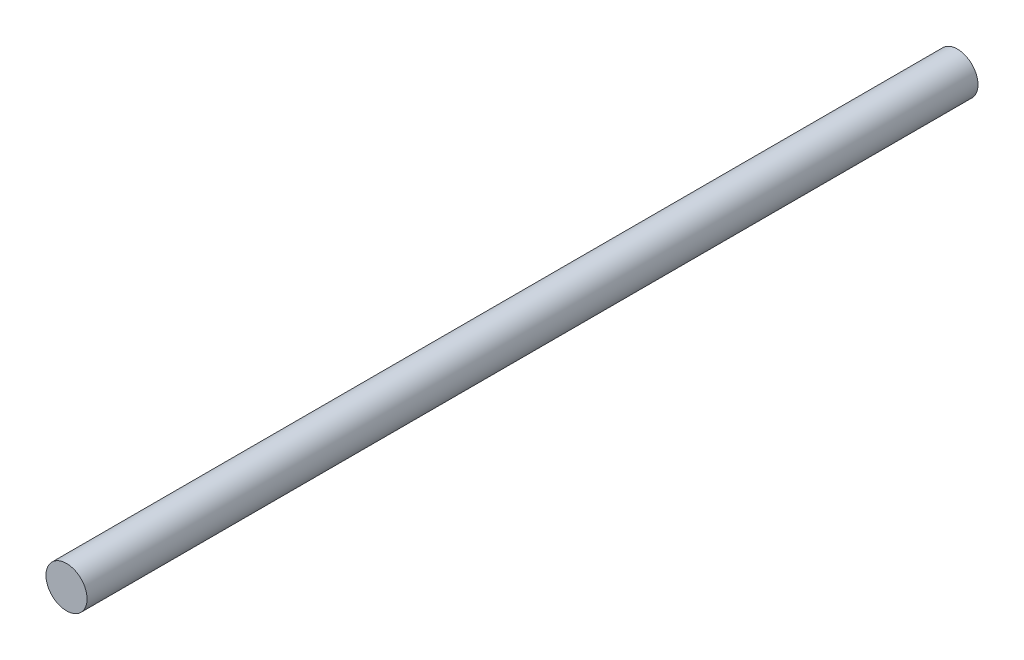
ISO-10303-21;
HEADER;
FILE_DESCRIPTION(('STEP AP214'),'2;1');
FILE_NAME('part.step','',(''),(''),'','','');
FILE_SCHEMA(('AUTOMOTIVE_DESIGN { 1 0 10303 214 1 1 1 1 }'));
ENDSEC;
DATA;
#1=APPLICATION_CONTEXT('core data for automotive mechanical design processes');
#2=APPLICATION_PROTOCOL_DEFINITION('international standard','automotive_design',2000,#1);
#3=PRODUCT_CONTEXT('',#1,'mechanical');
#4=PRODUCT('Part','Part','',(#3));
#5=PRODUCT_RELATED_PRODUCT_CATEGORY('part','',(#4));
#6=PRODUCT_DEFINITION_FORMATION('','',#4);
#7=PRODUCT_DEFINITION_CONTEXT('part definition',#1,'design');
#8=PRODUCT_DEFINITION('design','',#6,#7);
#9=PRODUCT_DEFINITION_SHAPE('','',#8);
#10=(LENGTH_UNIT() NAMED_UNIT(*) SI_UNIT(.MILLI.,.METRE.));
#11=(NAMED_UNIT(*) PLANE_ANGLE_UNIT() SI_UNIT($,.RADIAN.));
#12=(NAMED_UNIT(*) SI_UNIT($,.STERADIAN.) SOLID_ANGLE_UNIT());
#13=UNCERTAINTY_MEASURE_WITH_UNIT(LENGTH_MEASURE(1.E-05),#10,'distance_accuracy_value','');
#14=(GEOMETRIC_REPRESENTATION_CONTEXT(3) GLOBAL_UNCERTAINTY_ASSIGNED_CONTEXT((#13)) GLOBAL_UNIT_ASSIGNED_CONTEXT((#10,
#11,#12)) REPRESENTATION_CONTEXT('',''));
#15=CARTESIAN_POINT('',(0.,0.,0.));
#16=DIRECTION('',(0.,0.,1.));
#17=DIRECTION('',(1.,0.,0.));
#18=AXIS2_PLACEMENT_3D('',#15,#16,#17);
#19=CARTESIAN_POINT('',(0.,0.,-1300.));
#20=DIRECTION('',(0.,0.,1.));
#21=DIRECTION('',(1.,0.,0.));
#22=AXIS2_PLACEMENT_3D('',#19,#20,#21);
#23=CYLINDRICAL_SURFACE('',#22,30.);
#24=CARTESIAN_POINT('',(0.,0.,-1300.));
#25=DIRECTION('',(0.,0.,1.));
#26=DIRECTION('',(1.,0.,0.));
#27=AXIS2_PLACEMENT_3D('',#24,#25,#26);
#28=CIRCLE('',#27,30.);
#29=CARTESIAN_POINT('',(30.,0.,-1300.));
#30=VERTEX_POINT('',#29);
#31=EDGE_CURVE('E10',#30,#30,#28,.T.);
#32=ORIENTED_EDGE('',*,*,#31,.T.);
#33=EDGE_LOOP('',(#32));
#34=FACE_BOUND('',#33,.T.);
#35=CARTESIAN_POINT('',(0.,0.,0.));
#36=DIRECTION('',(0.,0.,1.));
#37=DIRECTION('',(1.,0.,0.));
#38=AXIS2_PLACEMENT_3D('',#35,#36,#37);
#39=CIRCLE('',#38,30.);
#40=CARTESIAN_POINT('',(30.,0.,0.));
#41=VERTEX_POINT('',#40);
#42=EDGE_CURVE('E40',#41,#41,#39,.T.);
#43=ORIENTED_EDGE('',*,*,#42,.F.);
#44=EDGE_LOOP('',(#43));
#45=FACE_BOUND('',#44,.T.);
#46=ADVANCED_FACE('F37',(#34,#45),#23,.T.);
#47=CARTESIAN_POINT('',(0.,0.,-1300.));
#48=DIRECTION('',(0.,0.,1.));
#49=DIRECTION('',(1.,0.,0.));
#50=AXIS2_PLACEMENT_3D('',#47,#48,#49);
#51=PLANE('',#50);
#52=ORIENTED_EDGE('',*,*,#31,.F.);
#53=EDGE_LOOP('',(#52));
#54=FACE_BOUND('',#53,.T.);
#55=ADVANCED_FACE('F54',(#54),#51,.F.);
#56=CARTESIAN_POINT('',(0.,0.,0.));
#57=DIRECTION('',(0.,0.,1.));
#58=DIRECTION('',(1.,0.,0.));
#59=AXIS2_PLACEMENT_3D('',#56,#57,#58);
#60=PLANE('',#59);
#61=ORIENTED_EDGE('',*,*,#42,.T.);
#62=EDGE_LOOP('',(#61));
#63=FACE_BOUND('',#62,.T.);
#64=ADVANCED_FACE('F51',(#63),#60,.T.);
#65=CLOSED_SHELL('',(#46,#55,#64));
#66=MANIFOLD_SOLID_BREP('B2',#65);
#67=ADVANCED_BREP_SHAPE_REPRESENTATION('',(#18,#66),#14);
#68=SHAPE_DEFINITION_REPRESENTATION(#9,#67);
ENDSEC;
END-ISO-10303-21;
